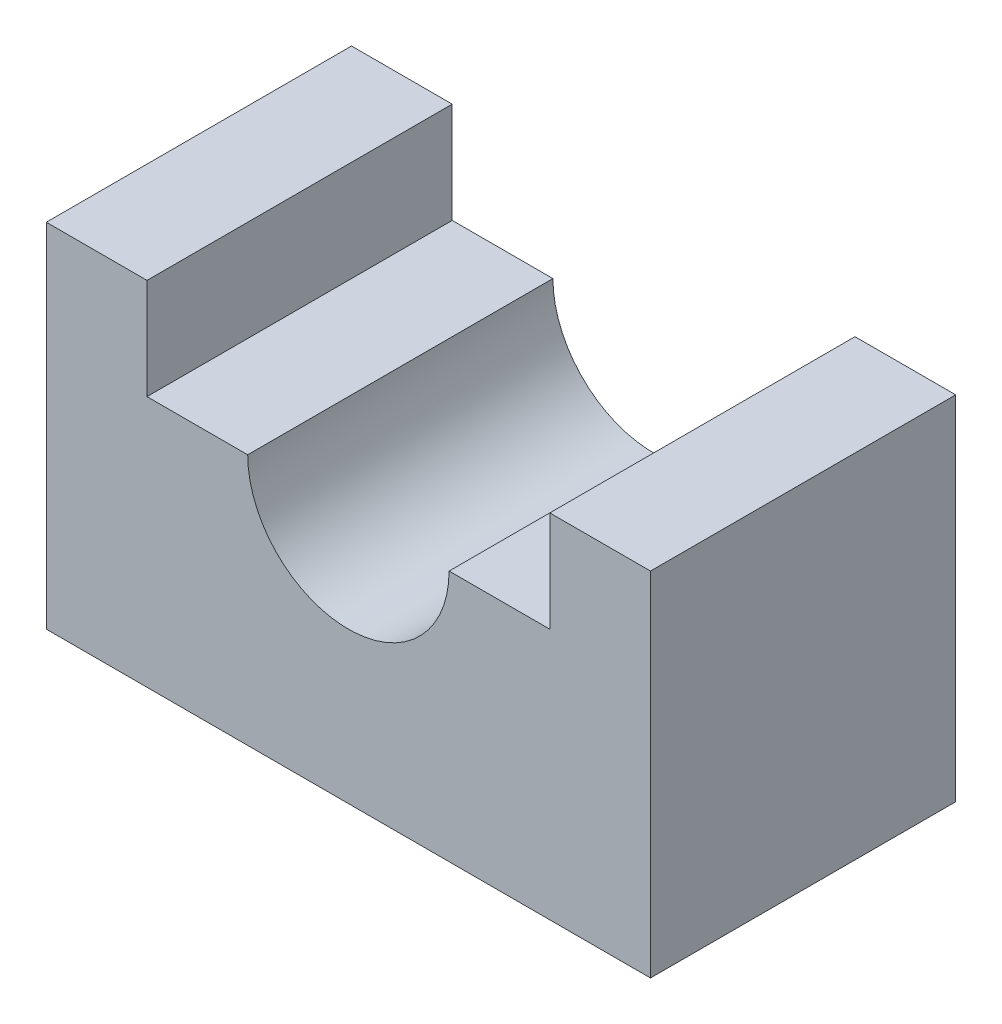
ISO-10303-21;
HEADER;
FILE_DESCRIPTION(('STEP AP214'),'2;1');
FILE_NAME('part.step','',(''),(''),'','','');
FILE_SCHEMA(('AUTOMOTIVE_DESIGN { 1 0 10303 214 1 1 1 1 }'));
ENDSEC;
DATA;
#1=APPLICATION_CONTEXT('core data for automotive mechanical design processes');
#2=APPLICATION_PROTOCOL_DEFINITION('international standard','automotive_design',2000,#1);
#3=PRODUCT_CONTEXT('',#1,'mechanical');
#4=PRODUCT('Part','Part','',(#3));
#5=PRODUCT_RELATED_PRODUCT_CATEGORY('part','',(#4));
#6=PRODUCT_DEFINITION_FORMATION('','',#4);
#7=PRODUCT_DEFINITION_CONTEXT('part definition',#1,'design');
#8=PRODUCT_DEFINITION('design','',#6,#7);
#9=PRODUCT_DEFINITION_SHAPE('','',#8);
#10=(LENGTH_UNIT() NAMED_UNIT(*) SI_UNIT(.MILLI.,.METRE.));
#11=(NAMED_UNIT(*) PLANE_ANGLE_UNIT() SI_UNIT($,.RADIAN.));
#12=(NAMED_UNIT(*) SI_UNIT($,.STERADIAN.) SOLID_ANGLE_UNIT());
#13=UNCERTAINTY_MEASURE_WITH_UNIT(LENGTH_MEASURE(1.E-05),#10,'distance_accuracy_value','');
#14=(GEOMETRIC_REPRESENTATION_CONTEXT(3) GLOBAL_UNCERTAINTY_ASSIGNED_CONTEXT((#13)) GLOBAL_UNIT_ASSIGNED_CONTEXT((#10,
#11,#12)) REPRESENTATION_CONTEXT('',''));
#15=CARTESIAN_POINT('',(0.,0.,0.));
#16=DIRECTION('',(0.,0.,1.));
#17=DIRECTION('',(1.,0.,0.));
#18=AXIS2_PLACEMENT_3D('',#15,#16,#17);
#19=CARTESIAN_POINT('',(30.,35.,15.155));
#20=DIRECTION('',(1.,0.,0.));
#21=DIRECTION('',(0.,1.,0.));
#22=AXIS2_PLACEMENT_3D('',#19,#20,#21);
#23=PLANE('',#22);
#24=DIRECTION('',(0.,-1.,0.));
#25=VECTOR('',#24,1.);
#26=CARTESIAN_POINT('',(30.,35.,-15.155));
#27=LINE('',#26,#25);
#28=CARTESIAN_POINT('',(30.,35.,-15.155));
#29=VERTEX_POINT('',#28);
#30=CARTESIAN_POINT('',(30.,0.,-15.155));
#31=VERTEX_POINT('',#30);
#32=EDGE_CURVE('E140',#29,#31,#27,.T.);
#33=ORIENTED_EDGE('',*,*,#32,.T.);
#34=DIRECTION('',(0.,0.,-1.));
#35=VECTOR('',#34,1.);
#36=CARTESIAN_POINT('',(30.,0.,15.155));
#37=LINE('',#36,#35);
#38=CARTESIAN_POINT('',(30.,0.,15.155));
#39=VERTEX_POINT('',#38);
#40=EDGE_CURVE('E11',#39,#31,#37,.T.);
#41=ORIENTED_EDGE('',*,*,#40,.F.);
#42=DIRECTION('',(0.,-1.,0.));
#43=VECTOR('',#42,1.);
#44=CARTESIAN_POINT('',(30.,35.,15.155));
#45=LINE('',#44,#43);
#46=CARTESIAN_POINT('',(30.,35.,15.155));
#47=VERTEX_POINT('',#46);
#48=EDGE_CURVE('E158',#47,#39,#45,.T.);
#49=ORIENTED_EDGE('',*,*,#48,.F.);
#50=DIRECTION('',(0.,0.,-1.));
#51=VECTOR('',#50,1.);
#52=CARTESIAN_POINT('',(30.,35.,15.155));
#53=LINE('',#52,#51);
#54=EDGE_CURVE('E136',#47,#29,#53,.T.);
#55=ORIENTED_EDGE('',*,*,#54,.T.);
#56=EDGE_LOOP('',(#33,#41,#49,#55));
#57=FACE_BOUND('',#56,.T.);
#58=ADVANCED_FACE('F32',(#57),#23,.F.);
#59=CARTESIAN_POINT('',(30.,0.,15.155));
#60=DIRECTION('',(0.,1.,0.));
#61=DIRECTION('',(0.,0.,1.));
#62=AXIS2_PLACEMENT_3D('',#59,#60,#61);
#63=PLANE('',#62);
#64=DIRECTION('',(1.,0.,0.));
#65=VECTOR('',#64,1.);
#66=CARTESIAN_POINT('',(30.,0.,-15.155));
#67=LINE('',#66,#65);
#68=CARTESIAN_POINT('',(90.,0.,-15.155));
#69=VERTEX_POINT('',#68);
#70=EDGE_CURVE('E143',#31,#69,#67,.T.);
#71=ORIENTED_EDGE('',*,*,#70,.T.);
#72=DIRECTION('',(0.,0.,-1.));
#73=VECTOR('',#72,1.);
#74=CARTESIAN_POINT('',(90.,0.,15.155));
#75=LINE('',#74,#73);
#76=CARTESIAN_POINT('',(90.,0.,15.155));
#77=VERTEX_POINT('',#76);
#78=EDGE_CURVE('E40',#77,#69,#75,.T.);
#79=ORIENTED_EDGE('',*,*,#78,.F.);
#80=DIRECTION('',(1.,0.,0.));
#81=VECTOR('',#80,1.);
#82=CARTESIAN_POINT('',(30.,0.,15.155));
#83=LINE('',#82,#81);
#84=EDGE_CURVE('E97',#39,#77,#83,.T.);
#85=ORIENTED_EDGE('',*,*,#84,.F.);
#86=ORIENTED_EDGE('',*,*,#40,.T.);
#87=EDGE_LOOP('',(#71,#79,#85,#86));
#88=FACE_BOUND('',#87,.T.);
#89=ADVANCED_FACE('F207',(#88),#63,.F.);
#90=CARTESIAN_POINT('',(90.,0.,15.155));
#91=DIRECTION('',(-1.,0.,0.));
#92=DIRECTION('',(0.,0.,1.));
#93=AXIS2_PLACEMENT_3D('',#90,#91,#92);
#94=PLANE('',#93);
#95=DIRECTION('',(0.,1.,0.));
#96=VECTOR('',#95,1.);
#97=CARTESIAN_POINT('',(90.,0.,-15.155));
#98=LINE('',#97,#96);
#99=CARTESIAN_POINT('',(90.,35.,-15.155));
#100=VERTEX_POINT('',#99);
#101=EDGE_CURVE('E145',#69,#100,#98,.T.);
#102=ORIENTED_EDGE('',*,*,#101,.T.);
#103=DIRECTION('',(0.,0.,-1.));
#104=VECTOR('',#103,1.);
#105=CARTESIAN_POINT('',(90.,35.,15.155));
#106=LINE('',#105,#104);
#107=CARTESIAN_POINT('',(90.,35.,15.155));
#108=VERTEX_POINT('',#107);
#109=EDGE_CURVE('E171',#108,#100,#106,.T.);
#110=ORIENTED_EDGE('',*,*,#109,.F.);
#111=DIRECTION('',(0.,1.,0.));
#112=VECTOR('',#111,1.);
#113=CARTESIAN_POINT('',(90.,0.,15.155));
#114=LINE('',#113,#112);
#115=EDGE_CURVE('E179',#77,#108,#114,.T.);
#116=ORIENTED_EDGE('',*,*,#115,.F.);
#117=ORIENTED_EDGE('',*,*,#78,.T.);
#118=EDGE_LOOP('',(#102,#110,#116,#117));
#119=FACE_BOUND('',#118,.T.);
#120=ADVANCED_FACE('F177',(#119),#94,.F.);
#121=CARTESIAN_POINT('',(90.,35.,15.155));
#122=DIRECTION('',(0.,-1.,0.));
#123=DIRECTION('',(0.,0.,-1.));
#124=AXIS2_PLACEMENT_3D('',#121,#122,#123);
#125=PLANE('',#124);
#126=DIRECTION('',(-1.,0.,0.));
#127=VECTOR('',#126,1.);
#128=CARTESIAN_POINT('',(90.,35.,-15.155));
#129=LINE('',#128,#127);
#130=CARTESIAN_POINT('',(80.,35.,-15.155));
#131=VERTEX_POINT('',#130);
#132=EDGE_CURVE('E147',#100,#131,#129,.T.);
#133=ORIENTED_EDGE('',*,*,#132,.T.);
#134=DIRECTION('',(0.,0.,-1.));
#135=VECTOR('',#134,1.);
#136=CARTESIAN_POINT('',(80.,35.,15.155));
#137=LINE('',#136,#135);
#138=CARTESIAN_POINT('',(80.,35.,15.155));
#139=VERTEX_POINT('',#138);
#140=EDGE_CURVE('E168',#139,#131,#137,.T.);
#141=ORIENTED_EDGE('',*,*,#140,.F.);
#142=DIRECTION('',(-1.,0.,0.));
#143=VECTOR('',#142,1.);
#144=CARTESIAN_POINT('',(90.,35.,15.155));
#145=LINE('',#144,#143);
#146=EDGE_CURVE('E197',#108,#139,#145,.T.);
#147=ORIENTED_EDGE('',*,*,#146,.F.);
#148=ORIENTED_EDGE('',*,*,#109,.T.);
#149=EDGE_LOOP('',(#133,#141,#147,#148));
#150=FACE_BOUND('',#149,.T.);
#151=ADVANCED_FACE('F188',(#150),#125,.F.);
#152=CARTESIAN_POINT('',(80.,35.,15.155));
#153=DIRECTION('',(1.,0.,0.));
#154=DIRECTION('',(0.,0.,-1.));
#155=AXIS2_PLACEMENT_3D('',#152,#153,#154);
#156=PLANE('',#155);
#157=DIRECTION('',(0.,-1.,0.));
#158=VECTOR('',#157,1.);
#159=CARTESIAN_POINT('',(80.,35.,-15.155));
#160=LINE('',#159,#158);
#161=CARTESIAN_POINT('',(80.,25.,-15.155));
#162=VERTEX_POINT('',#161);
#163=EDGE_CURVE('E149',#131,#162,#160,.T.);
#164=ORIENTED_EDGE('',*,*,#163,.T.);
#165=DIRECTION('',(0.,0.,-1.));
#166=VECTOR('',#165,1.);
#167=CARTESIAN_POINT('',(80.,25.,15.155));
#168=LINE('',#167,#166);
#169=CARTESIAN_POINT('',(80.,25.,15.155));
#170=VERTEX_POINT('',#169);
#171=EDGE_CURVE('E165',#170,#162,#168,.T.);
#172=ORIENTED_EDGE('',*,*,#171,.F.);
#173=DIRECTION('',(0.,-1.,0.));
#174=VECTOR('',#173,1.);
#175=CARTESIAN_POINT('',(80.,35.,15.155));
#176=LINE('',#175,#174);
#177=EDGE_CURVE('E194',#139,#170,#176,.T.);
#178=ORIENTED_EDGE('',*,*,#177,.F.);
#179=ORIENTED_EDGE('',*,*,#140,.T.);
#180=EDGE_LOOP('',(#164,#172,#178,#179));
#181=FACE_BOUND('',#180,.T.);
#182=ADVANCED_FACE('F192',(#181),#156,.F.);
#183=CARTESIAN_POINT('',(80.,25.,15.155));
#184=DIRECTION('',(0.,-1.,0.));
#185=DIRECTION('',(0.,0.,-1.));
#186=AXIS2_PLACEMENT_3D('',#183,#184,#185);
#187=PLANE('',#186);
#188=DIRECTION('',(-1.,0.,0.));
#189=VECTOR('',#188,1.);
#190=CARTESIAN_POINT('',(80.,25.,-15.155));
#191=LINE('',#190,#189);
#192=CARTESIAN_POINT('',(70.,25.,-15.155));
#193=VERTEX_POINT('',#192);
#194=EDGE_CURVE('E151',#162,#193,#191,.T.);
#195=ORIENTED_EDGE('',*,*,#194,.T.);
#196=DIRECTION('',(0.,0.,-1.));
#197=VECTOR('',#196,1.);
#198=CARTESIAN_POINT('',(70.,25.,15.155));
#199=LINE('',#198,#197);
#200=CARTESIAN_POINT('',(70.,25.,15.155));
#201=VERTEX_POINT('',#200);
#202=EDGE_CURVE('E162',#201,#193,#199,.T.);
#203=ORIENTED_EDGE('',*,*,#202,.F.);
#204=DIRECTION('',(-1.,0.,0.));
#205=VECTOR('',#204,1.);
#206=CARTESIAN_POINT('',(80.,25.,15.155));
#207=LINE('',#206,#205);
#208=EDGE_CURVE('E196',#170,#201,#207,.T.);
#209=ORIENTED_EDGE('',*,*,#208,.F.);
#210=ORIENTED_EDGE('',*,*,#171,.T.);
#211=EDGE_LOOP('',(#195,#203,#209,#210));
#212=FACE_BOUND('',#211,.T.);
#213=ADVANCED_FACE('F219',(#212),#187,.F.);
#214=CARTESIAN_POINT('',(60.,25.,15.155));
#215=DIRECTION('',(0.,0.,-1.));
#216=DIRECTION('',(-1.,0.,0.));
#217=AXIS2_PLACEMENT_3D('',#214,#215,#216);
#218=CYLINDRICAL_SURFACE('',#217,10.);
#219=CARTESIAN_POINT('',(60.,25.,-15.155));
#220=DIRECTION('',(0.,0.,-1.));
#221=DIRECTION('',(-1.,0.,0.));
#222=AXIS2_PLACEMENT_3D('',#219,#220,#221);
#223=CIRCLE('',#222,10.);
#224=CARTESIAN_POINT('',(50.,25.,-15.155));
#225=VERTEX_POINT('',#224);
#226=EDGE_CURVE('E153',#193,#225,#223,.T.);
#227=ORIENTED_EDGE('',*,*,#226,.T.);
#228=DIRECTION('',(0.,0.,-1.));
#229=VECTOR('',#228,1.);
#230=CARTESIAN_POINT('',(50.,25.,15.155));
#231=LINE('',#230,#229);
#232=CARTESIAN_POINT('',(50.,25.,15.155));
#233=VERTEX_POINT('',#232);
#234=EDGE_CURVE('E131',#233,#225,#231,.T.);
#235=ORIENTED_EDGE('',*,*,#234,.F.);
#236=CARTESIAN_POINT('',(60.,25.,15.155));
#237=DIRECTION('',(0.,0.,-1.));
#238=DIRECTION('',(-1.,0.,0.));
#239=AXIS2_PLACEMENT_3D('',#236,#237,#238);
#240=CIRCLE('',#239,10.);
#241=EDGE_CURVE('E122',#201,#233,#240,.T.);
#242=ORIENTED_EDGE('',*,*,#241,.F.);
#243=ORIENTED_EDGE('',*,*,#202,.T.);
#244=EDGE_LOOP('',(#227,#235,#242,#243));
#245=FACE_BOUND('',#244,.T.);
#246=ADVANCED_FACE('F222',(#245),#218,.F.);
#247=CARTESIAN_POINT('',(50.,25.,15.155));
#248=DIRECTION('',(0.,-1.,0.));
#249=DIRECTION('',(0.,0.,-1.));
#250=AXIS2_PLACEMENT_3D('',#247,#248,#249);
#251=PLANE('',#250);
#252=DIRECTION('',(-1.,0.,0.));
#253=VECTOR('',#252,1.);
#254=CARTESIAN_POINT('',(50.,25.,-15.155));
#255=LINE('',#254,#253);
#256=CARTESIAN_POINT('',(40.,25.,-15.155));
#257=VERTEX_POINT('',#256);
#258=EDGE_CURVE('E130',#225,#257,#255,.T.);
#259=ORIENTED_EDGE('',*,*,#258,.T.);
#260=DIRECTION('',(0.,0.,-1.));
#261=VECTOR('',#260,1.);
#262=CARTESIAN_POINT('',(40.,25.,15.155));
#263=LINE('',#262,#261);
#264=CARTESIAN_POINT('',(40.,25.,15.155));
#265=VERTEX_POINT('',#264);
#266=EDGE_CURVE('E127',#265,#257,#263,.T.);
#267=ORIENTED_EDGE('',*,*,#266,.F.);
#268=DIRECTION('',(-1.,0.,0.));
#269=VECTOR('',#268,1.);
#270=CARTESIAN_POINT('',(50.,25.,15.155));
#271=LINE('',#270,#269);
#272=EDGE_CURVE('E116',#233,#265,#271,.T.);
#273=ORIENTED_EDGE('',*,*,#272,.F.);
#274=ORIENTED_EDGE('',*,*,#234,.T.);
#275=EDGE_LOOP('',(#259,#267,#273,#274));
#276=FACE_BOUND('',#275,.T.);
#277=ADVANCED_FACE('F128',(#276),#251,.F.);
#278=CARTESIAN_POINT('',(40.,25.,15.155));
#279=DIRECTION('',(-1.,0.,0.));
#280=DIRECTION('',(0.,-1.,0.));
#281=AXIS2_PLACEMENT_3D('',#278,#279,#280);
#282=PLANE('',#281);
#283=DIRECTION('',(0.,1.,0.));
#284=VECTOR('',#283,1.);
#285=CARTESIAN_POINT('',(40.,25.,-15.155));
#286=LINE('',#285,#284);
#287=CARTESIAN_POINT('',(40.,35.,-15.155));
#288=VERTEX_POINT('',#287);
#289=EDGE_CURVE('E83',#257,#288,#286,.T.);
#290=ORIENTED_EDGE('',*,*,#289,.T.);
#291=DIRECTION('',(0.,0.,-1.));
#292=VECTOR('',#291,1.);
#293=CARTESIAN_POINT('',(40.,35.,15.155));
#294=LINE('',#293,#292);
#295=CARTESIAN_POINT('',(40.,35.,15.155));
#296=VERTEX_POINT('',#295);
#297=EDGE_CURVE('E132',#296,#288,#294,.T.);
#298=ORIENTED_EDGE('',*,*,#297,.F.);
#299=DIRECTION('',(0.,1.,0.));
#300=VECTOR('',#299,1.);
#301=CARTESIAN_POINT('',(40.,25.,15.155));
#302=LINE('',#301,#300);
#303=EDGE_CURVE('E120',#265,#296,#302,.T.);
#304=ORIENTED_EDGE('',*,*,#303,.F.);
#305=ORIENTED_EDGE('',*,*,#266,.T.);
#306=EDGE_LOOP('',(#290,#298,#304,#305));
#307=FACE_BOUND('',#306,.T.);
#308=ADVANCED_FACE('F134',(#307),#282,.F.);
#309=CARTESIAN_POINT('',(40.,35.,15.155));
#310=DIRECTION('',(0.,-1.,0.));
#311=DIRECTION('',(0.,0.,-1.));
#312=AXIS2_PLACEMENT_3D('',#309,#310,#311);
#313=PLANE('',#312);
#314=DIRECTION('',(-1.,0.,0.));
#315=VECTOR('',#314,1.);
#316=CARTESIAN_POINT('',(40.,35.,-15.155));
#317=LINE('',#316,#315);
#318=EDGE_CURVE('E89',#288,#29,#317,.T.);
#319=ORIENTED_EDGE('',*,*,#318,.T.);
#320=ORIENTED_EDGE('',*,*,#54,.F.);
#321=DIRECTION('',(-1.,0.,0.));
#322=VECTOR('',#321,1.);
#323=CARTESIAN_POINT('',(40.,35.,15.155));
#324=LINE('',#323,#322);
#325=EDGE_CURVE('E48',#296,#47,#324,.T.);
#326=ORIENTED_EDGE('',*,*,#325,.F.);
#327=ORIENTED_EDGE('',*,*,#297,.T.);
#328=EDGE_LOOP('',(#319,#320,#326,#327));
#329=FACE_BOUND('',#328,.T.);
#330=ADVANCED_FACE('F231',(#329),#313,.F.);
#331=CARTESIAN_POINT('',(60.,25.,15.155));
#332=DIRECTION('',(0.,0.,-1.));
#333=DIRECTION('',(-1.,0.,0.));
#334=AXIS2_PLACEMENT_3D('',#331,#332,#333);
#335=PLANE('',#334);
#336=ORIENTED_EDGE('',*,*,#48,.T.);
#337=ORIENTED_EDGE('',*,*,#84,.T.);
#338=ORIENTED_EDGE('',*,*,#115,.T.);
#339=ORIENTED_EDGE('',*,*,#146,.T.);
#340=ORIENTED_EDGE('',*,*,#177,.T.);
#341=ORIENTED_EDGE('',*,*,#208,.T.);
#342=ORIENTED_EDGE('',*,*,#241,.T.);
#343=ORIENTED_EDGE('',*,*,#272,.T.);
#344=ORIENTED_EDGE('',*,*,#303,.T.);
#345=ORIENTED_EDGE('',*,*,#325,.T.);
#346=EDGE_LOOP('',(#336,#337,#338,#339,#340,#341,#342,#343,#344,#345));
#347=FACE_BOUND('',#346,.T.);
#348=ADVANCED_FACE('F118',(#347),#335,.F.);
#349=CARTESIAN_POINT('',(60.,25.,-15.155));
#350=DIRECTION('',(0.,0.,-1.));
#351=DIRECTION('',(-1.,0.,0.));
#352=AXIS2_PLACEMENT_3D('',#349,#350,#351);
#353=PLANE('',#352);
#354=ORIENTED_EDGE('',*,*,#32,.F.);
#355=ORIENTED_EDGE('',*,*,#318,.F.);
#356=ORIENTED_EDGE('',*,*,#289,.F.);
#357=ORIENTED_EDGE('',*,*,#258,.F.);
#358=ORIENTED_EDGE('',*,*,#226,.F.);
#359=ORIENTED_EDGE('',*,*,#194,.F.);
#360=ORIENTED_EDGE('',*,*,#163,.F.);
#361=ORIENTED_EDGE('',*,*,#132,.F.);
#362=ORIENTED_EDGE('',*,*,#101,.F.);
#363=ORIENTED_EDGE('',*,*,#70,.F.);
#364=EDGE_LOOP('',(#354,#355,#356,#357,#358,#359,#360,#361,#362,#363));
#365=FACE_BOUND('',#364,.T.);
#366=ADVANCED_FACE('F183',(#365),#353,.T.);
#367=CLOSED_SHELL('',(#58,#89,#120,#151,#182,#213,#246,#277,#308,#330,#348,#366));
#368=MANIFOLD_SOLID_BREP('B2',#367);
#369=ADVANCED_BREP_SHAPE_REPRESENTATION('',(#18,#368),#14);
#370=SHAPE_DEFINITION_REPRESENTATION(#9,#369);
ENDSEC;
END-ISO-10303-21;
